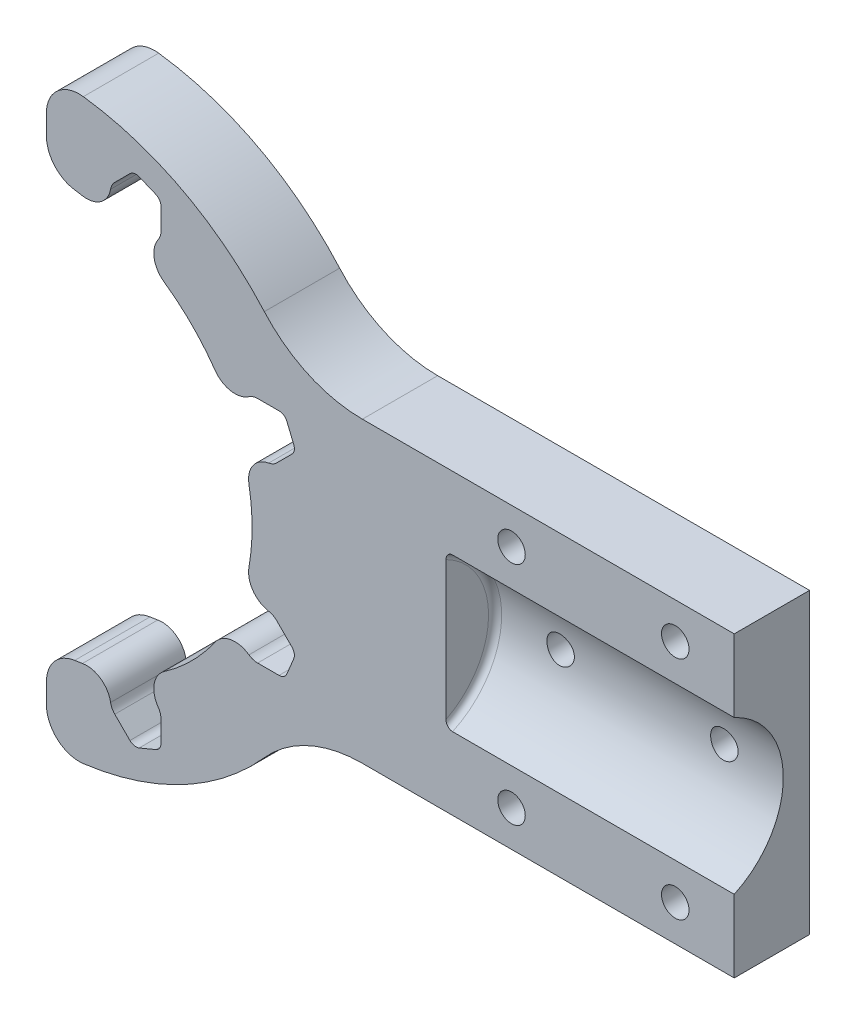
from build123d import *

# Parameters (mm, degrees)
BOSS_EXTRUDE1_DEPTH     = 50
BOSS_EXTRUDE2_DEPTH     = 11.5
BOSS_EXTRUDE3_DEPTH     = 6
CUT_EXTRUDE1_DEPTH      = 72.645324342
FILLET6_R               = 20
FILLET7_R               = 1
SKETCH6_R               = 2.1
CUT_EXTRUDE2_DEPTH      = 72.64532448
BOSS_EXTRUDE4_START     = -11.5
BOSS_EXTRUDE4_DEPTH     = 11.5
FILLET11_R              = 5
CUT_EXTRUDE3_DEPTH      = 72.448380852
CUT_EXTRUDE3_DEPTH_BACK = 72.448380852
SKETCH9_R               = 2.1


with BuildPart() as part:
    # Sketch1 → Boss-Extrude1 (new body)
    with BuildSketch(Plane.YZ):
        with BuildLine():
            Line((-11.683321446, 0), (-22.75, 0))
            Line((-22.75, 0), (-22.75, -11.5))
            Line((-22.75, -11.5), (22.75, -11.5))
            Line((22.75, -11.5), (22.75, 0))
            Line((22.75, 0), (11.683321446, 0))
            ThreePointArc((11.683321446, 0), (0, -7.5), (-11.683321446, 0))
        make_face()
    extrude(amount=BOSS_EXTRUDE1_DEPTH)

    # Sketch3 → Boss-Extrude2 (add)
    with BuildSketch(Plane.XY):
        with BuildLine():
            Line((0, 22.75), (-16.813091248, 22.75))
            ThreePointArc((-16.813091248, 22.75), (-33.039068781, 38.646086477), (-55, 44.45))
            Line((-55, 44.45), (-55, -44.45))
            ThreePointArc((-55, -44.45), (-33.039068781, -38.646086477), (-16.813091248, -22.75))
            Line((-16.813091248, -22.75), (0, -22.75))
            Line((0, -22.75), (0, 22.75))
        make_face()
    extrude(amount=-BOSS_EXTRUDE2_DEPTH)

    # Sketch4 → Boss-Extrude3 (add)
    with BuildSketch(Plane.YZ):
        with BuildLine():
            Line((11.683321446, 0), (-11.683321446, 0))
            ThreePointArc((-11.683321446, 0), (0, -7.5), (11.683321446, 0))
        make_face()
    extrude(amount=BOSS_EXTRUDE3_DEPTH)

    # Sketch5 → Cut-Extrude1 (cut, through all)
    with BuildSketch(Plane(origin=(0, 0, -11.5), x_dir=(1, 0, 0), z_dir=(0, 0, -1))):
        with BuildLine():
            Line((-18.104928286, 16.759017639), (-17.06082958, 14.238340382))
            ThreePointArc((-17.06082958, 14.238340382), (-16.975470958, 13.371679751), (-17.385988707, 12.603655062))
            Line((-17.385988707, 12.603655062), (-19.698227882, 10.291415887))
            ThreePointArc((-19.698227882, 10.291415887), (-20.315069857, 9.839864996), (-21.039526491, 9.595826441))
            ThreePointArc((-21.039526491, 9.595826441), (-23.307895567, 8.156938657), (-23.888378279, 5.534166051))
            ThreePointArc((-23.888378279, 5.534166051), (-23.4, 0), (-23.888378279, -5.534166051))
            ThreePointArc((-23.888378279, -5.534166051), (-23.307895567, -8.156938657), (-21.039526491, -9.595826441))
            ThreePointArc((-21.039526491, -9.595826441), (-20.315069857, -9.839864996), (-19.698227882, -10.291415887))
            Line((-19.698227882, -10.291415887), (-17.385988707, -12.603655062))
            ThreePointArc((-17.385988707, -12.603655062), (-16.975470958, -13.371679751), (-17.06082958, -14.238340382))
            Line((-17.06082958, -14.238340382), (-18.104928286, -16.759017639))
            ThreePointArc((-18.104928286, -16.759017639), (-18.657392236, -17.432196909), (-19.490747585, -17.684992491))
            Line((-19.490747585, -17.684992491), (-22.760747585, -17.684992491))
            ThreePointArc((-22.760747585, -17.684992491), (-23.516215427, -17.568114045), (-24.201044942, -17.228407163))
            ThreePointArc((-24.201044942, -17.228407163), (-26.822471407, -16.641875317), (-29.087514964, -18.085992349))
            ThreePointArc((-29.087514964, -18.085992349), (-32.655425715, -22.344574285), (-36.914007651, -25.912485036))
            ThreePointArc((-36.914007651, -25.912485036), (-38.358124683, -28.177528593), (-37.771592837, -30.798955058))
            ThreePointArc((-37.771592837, -30.798955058), (-37.431885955, -31.483784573), (-37.315007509, -32.239252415))
            Line((-37.315007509, -32.239252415), (-37.315007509, -35.509252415))
            ThreePointArc((-37.315007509, -35.509252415), (-37.567803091, -36.342607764), (-38.240982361, -36.895071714))
            Line((-38.240982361, -36.895071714), (-40.761659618, -37.93917042))
            ThreePointArc((-40.761659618, -37.93917042), (-41.628320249, -38.024529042), (-42.396344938, -37.614011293))
            Line((-42.396344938, -37.614011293), (-44.708584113, -35.301772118))
            ThreePointArc((-44.708584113, -35.301772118), (-45.160135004, -34.684930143), (-45.404173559, -33.960473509))
            ThreePointArc((-45.404173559, -33.960473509), (-46.843061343, -31.692104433), (-49.465833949, -31.111621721))
            ThreePointArc((-49.465833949, -31.111621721), (-52.222163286, -31.477668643), (-55, -31.6))
            Line((-55, -31.6), (-55, 31.6))
            ThreePointArc((-55, 31.6), (-52.222163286, 31.477668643), (-49.465833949, 31.111621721))
            ThreePointArc((-49.465833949, 31.111621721), (-46.843061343, 31.692104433), (-45.404173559, 33.960473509))
            ThreePointArc((-45.404173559, 33.960473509), (-45.160135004, 34.684930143), (-44.708584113, 35.301772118))
            Line((-44.708584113, 35.301772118), (-42.396344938, 37.614011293))
            ThreePointArc((-42.396344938, 37.614011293), (-41.628320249, 38.024529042), (-40.761659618, 37.93917042))
            Line((-40.761659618, 37.93917042), (-38.240982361, 36.895071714))
            ThreePointArc((-38.240982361, 36.895071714), (-37.567803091, 36.342607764), (-37.315007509, 35.509252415))
            Line((-37.315007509, 35.509252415), (-37.315007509, 32.239252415))
            ThreePointArc((-37.315007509, 32.239252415), (-37.431885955, 31.483784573), (-37.771592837, 30.798955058))
            ThreePointArc((-37.771592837, 30.798955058), (-38.358124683, 28.177528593), (-36.914007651, 25.912485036))
            ThreePointArc((-36.914007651, 25.912485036), (-32.655425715, 22.344574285), (-29.087514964, 18.085992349))
            ThreePointArc((-29.087514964, 18.085992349), (-26.822471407, 16.641875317), (-24.201044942, 17.228407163))
            ThreePointArc((-24.201044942, 17.228407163), (-23.516215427, 17.568114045), (-22.760747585, 17.684992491))
            Line((-22.760747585, 17.684992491), (-19.490747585, 17.684992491))
            ThreePointArc((-19.490747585, 17.684992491), (-18.657392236, 17.432196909), (-18.104928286, 16.759017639))
        make_face()
    extrude(amount=-CUT_EXTRUDE1_DEPTH, mode=Mode.SUBTRACT)

    # Fillet6
    fillet6_edges = [part.edges().sort_by_distance(p)[0] for p in [
        (-16.813091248, -22.75, -5.75),
        (-16.813091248, 22.75, -5.75),
    ]]
    fillet(fillet6_edges, radius=FILLET6_R)

    # Fillet7
    fillet7_edges = [part.edges().sort_by_distance(p)[0] for p in [
        (6, 0, -7.5),
    ]]
    fillet(fillet7_edges, radius=FILLET7_R)

    # Sketch6 → Cut-Extrude2 (cut, through all)
    with BuildSketch(Plane.XY):
        with Locations((41, 17.25)):
            Circle(SKETCH6_R)
        with Locations((16, 17.25)):
            Circle(SKETCH6_R)
        with Locations((16, -17.25)):
            Circle(SKETCH6_R)
        with Locations((41, -17.25)):
            Circle(SKETCH6_R)
    extrude(amount=-CUT_EXTRUDE2_DEPTH, mode=Mode.SUBTRACT)

    # Sketch8 → Boss-Extrude4 (add)
    with BuildSketch(Plane.XY.offset(BOSS_EXTRUDE4_START)):
        with BuildLine():
            Line((-19.490747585, -17.484992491), (-22.760747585, -17.484992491))
            ThreePointArc((-22.760747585, -17.484992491), (-23.455777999, -17.37746432), (-24.085821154, -17.064933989))
            ThreePointArc((-24.085821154, -17.064933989), (-26.857043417, -16.444886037), (-29.251518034, -17.971524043))
            ThreePointArc((-29.251518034, -17.971524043), (-32.796847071, -22.203152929), (-37.028475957, -25.748481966))
            ThreePointArc((-37.028475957, -25.748481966), (-38.555113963, -28.142956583), (-37.935066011, -30.914178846))
            ThreePointArc((-37.935066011, -30.914178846), (-37.62253568, -31.544222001), (-37.515007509, -32.239252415))
            Line((-37.515007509, -32.239252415), (-37.515007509, -35.509252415))
            ThreePointArc((-37.515007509, -35.509252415), (-37.734097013, -36.231493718), (-38.317519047, -36.710295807))
            Line((-38.317519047, -36.710295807), (-40.838196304, -37.754394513))
            ThreePointArc((-40.838196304, -37.754394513), (-41.589302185, -37.828371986), (-42.254923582, -37.472589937))
            Line((-42.254923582, -37.472589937), (-44.567162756, -35.160350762))
            ThreePointArc((-44.567162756, -35.160350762), (-44.982589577, -34.592856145), (-45.207105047, -33.926356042))
            ThreePointArc((-45.207105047, -33.926356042), (-46.72821499, -31.528365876), (-49.500860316, -30.914712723))
            ThreePointArc((-49.500860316, -30.914712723), (-52.239744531, -31.278442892), (-55, -31.4))
            Line((-55, -31.4), (-55, -31.6))
            ThreePointArc((-55, -31.6), (-52.222163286, -31.477668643), (-49.465833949, -31.111621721))
            ThreePointArc((-49.465833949, -31.111621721), (-46.843061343, -31.692104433), (-45.404173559, -33.960473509))
            ThreePointArc((-45.404173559, -33.960473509), (-45.160135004, -34.684930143), (-44.708584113, -35.301772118))
            Line((-44.708584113, -35.301772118), (-42.396344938, -37.614011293))
            ThreePointArc((-42.396344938, -37.614011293), (-41.628320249, -38.024529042), (-40.761659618, -37.93917042))
            Line((-40.761659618, -37.93917042), (-38.240982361, -36.895071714))
            ThreePointArc((-38.240982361, -36.895071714), (-37.567803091, -36.342607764), (-37.315007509, -35.509252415))
            Line((-37.315007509, -35.509252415), (-37.315007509, -32.239252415))
            ThreePointArc((-37.315007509, -32.239252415), (-37.431885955, -31.483784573), (-37.771592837, -30.798955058))
            ThreePointArc((-37.771592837, -30.798955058), (-38.358124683, -28.177528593), (-36.914007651, -25.912485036))
            ThreePointArc((-36.914007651, -25.912485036), (-32.655425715, -22.344574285), (-29.087514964, -18.085992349))
            ThreePointArc((-29.087514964, -18.085992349), (-26.822471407, -16.641875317), (-24.201044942, -17.228407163))
            ThreePointArc((-24.201044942, -17.228407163), (-23.516215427, -17.568114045), (-22.760747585, -17.684992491))
            Line((-22.760747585, -17.684992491), (-19.490747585, -17.684992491))
            ThreePointArc((-19.490747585, -17.684992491), (-18.657392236, -17.432196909), (-18.104928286, -16.759017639))
            Line((-18.104928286, -16.759017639), (-17.06082958, -14.238340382))
            ThreePointArc((-17.06082958, -14.238340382), (-16.975470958, -13.371679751), (-17.385988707, -12.603655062))
            Line((-17.385988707, -12.603655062), (-19.698227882, -10.291415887))
            ThreePointArc((-19.698227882, -10.291415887), (-20.315069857, -9.839864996), (-21.039526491, -9.595826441))
            ThreePointArc((-21.039526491, -9.595826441), (-23.307895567, -8.156938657), (-23.888378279, -5.534166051))
            ThreePointArc((-23.888378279, -5.534166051), (-23.4, 0), (-23.888378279, 5.534166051))
            ThreePointArc((-23.888378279, 5.534166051), (-23.307895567, 8.156938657), (-21.039526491, 9.595826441))
            ThreePointArc((-21.039526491, 9.595826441), (-20.315069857, 9.839864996), (-19.698227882, 10.291415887))
            Line((-19.698227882, 10.291415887), (-17.385988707, 12.603655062))
            ThreePointArc((-17.385988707, 12.603655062), (-16.975470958, 13.371679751), (-17.06082958, 14.238340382))
            Line((-17.06082958, 14.238340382), (-18.104928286, 16.759017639))
            ThreePointArc((-18.104928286, 16.759017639), (-18.657392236, 17.432196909), (-19.490747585, 17.684992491))
            Line((-19.490747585, 17.684992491), (-22.760747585, 17.684992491))
            ThreePointArc((-22.760747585, 17.684992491), (-23.516215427, 17.568114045), (-24.201044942, 17.228407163))
            ThreePointArc((-24.201044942, 17.228407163), (-26.822471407, 16.641875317), (-29.087514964, 18.085992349))
            ThreePointArc((-29.087514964, 18.085992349), (-32.655425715, 22.344574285), (-36.914007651, 25.912485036))
            ThreePointArc((-36.914007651, 25.912485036), (-38.358124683, 28.177528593), (-37.771592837, 30.798955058))
            ThreePointArc((-37.771592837, 30.798955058), (-37.431885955, 31.483784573), (-37.315007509, 32.239252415))
            Line((-37.315007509, 32.239252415), (-37.315007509, 35.509252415))
            ThreePointArc((-37.315007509, 35.509252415), (-37.567803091, 36.342607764), (-38.240982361, 36.895071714))
            Line((-38.240982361, 36.895071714), (-40.761659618, 37.93917042))
            ThreePointArc((-40.761659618, 37.93917042), (-41.628320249, 38.024529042), (-42.396344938, 37.614011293))
            Line((-42.396344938, 37.614011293), (-44.708584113, 35.301772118))
            ThreePointArc((-44.708584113, 35.301772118), (-45.160135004, 34.684930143), (-45.404173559, 33.960473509))
            ThreePointArc((-45.404173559, 33.960473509), (-46.843061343, 31.692104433), (-49.465833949, 31.111621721))
            ThreePointArc((-49.465833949, 31.111621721), (-52.222163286, 31.477668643), (-55, 31.6))
            Line((-55, 31.6), (-55, 31.4))
            ThreePointArc((-55, 31.4), (-52.239744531, 31.278442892), (-49.500860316, 30.914712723))
            ThreePointArc((-49.500860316, 30.914712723), (-46.72821499, 31.528365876), (-45.207105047, 33.926356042))
            ThreePointArc((-45.207105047, 33.926356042), (-44.982589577, 34.592856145), (-44.567162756, 35.160350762))
            Line((-44.567162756, 35.160350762), (-42.254923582, 37.472589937))
            ThreePointArc((-42.254923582, 37.472589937), (-41.589302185, 37.828371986), (-40.838196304, 37.754394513))
            Line((-40.838196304, 37.754394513), (-38.317519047, 36.710295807))
            ThreePointArc((-38.317519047, 36.710295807), (-37.734097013, 36.231493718), (-37.515007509, 35.509252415))
            Line((-37.515007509, 35.509252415), (-37.515007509, 32.239252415))
            ThreePointArc((-37.515007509, 32.239252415), (-37.62253568, 31.544222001), (-37.935066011, 30.914178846))
            ThreePointArc((-37.935066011, 30.914178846), (-38.555113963, 28.142956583), (-37.028475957, 25.748481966))
            ThreePointArc((-37.028475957, 25.748481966), (-32.796847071, 22.203152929), (-29.251518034, 17.971524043))
            ThreePointArc((-29.251518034, 17.971524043), (-26.857043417, 16.444886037), (-24.085821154, 17.064933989))
            ThreePointArc((-24.085821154, 17.064933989), (-23.455777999, 17.37746432), (-22.760747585, 17.484992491))
            Line((-22.760747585, 17.484992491), (-19.490747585, 17.484992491))
            ThreePointArc((-19.490747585, 17.484992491), (-18.768506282, 17.265902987), (-18.289704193, 16.682480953))
            Line((-18.289704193, 16.682480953), (-17.245605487, 14.161803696))
            ThreePointArc((-17.245605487, 14.161803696), (-17.171628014, 13.410697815), (-17.527410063, 12.745076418))
            Line((-17.527410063, 12.745076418), (-19.839649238, 10.432837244))
            ThreePointArc((-19.839649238, 10.432837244), (-20.407143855, 10.017410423), (-21.073643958, 9.792894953))
            ThreePointArc((-21.073643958, 9.792894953), (-23.471634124, 8.27178501), (-24.085287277, 5.499139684))
            ThreePointArc((-24.085287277, 5.499139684), (-23.6, 0), (-24.085287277, -5.499139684))
            ThreePointArc((-24.085287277, -5.499139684), (-23.471634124, -8.27178501), (-21.073643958, -9.792894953))
            ThreePointArc((-21.073643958, -9.792894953), (-20.407143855, -10.017410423), (-19.839649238, -10.432837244))
            Line((-19.839649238, -10.432837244), (-17.527410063, -12.745076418))
            ThreePointArc((-17.527410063, -12.745076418), (-17.171628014, -13.410697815), (-17.245605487, -14.161803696))
            Line((-17.245605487, -14.161803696), (-18.289704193, -16.682480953))
            ThreePointArc((-18.289704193, -16.682480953), (-18.768506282, -17.265902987), (-19.490747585, -17.484992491))
        make_face()
    extrude(amount=BOSS_EXTRUDE4_DEPTH)

    # Fillet11
    fillet11_edges = [part.edges().sort_by_distance(p)[0] for p in [
        (-55, -44.45, -5.75),
        (-55, 44.45, -5.75),
        (-55, -31.4, -5.75),
        (-55, 31.4, -5.75),
    ]]
    fillet(fillet11_edges, radius=FILLET11_R)

    # Sketch9 → Cut-Extrude3 (cut, two sides: drawn at the far end of the back side and taken through both)
    with BuildSketch(Plane(origin=(0, 0, -11.5), x_dir=(1, 0, 0), z_dir=(0, 0, -1)).offset(-CUT_EXTRUDE3_DEPTH_BACK)):
        with Locations(Location((16, 0, 0), (0, 0, 180))):
            Circle(SKETCH9_R)
        with Locations(Location((41, 0, 0), (0, 0, 180))):
            Circle(SKETCH9_R)
    extrude(amount=CUT_EXTRUDE3_DEPTH + CUT_EXTRUDE3_DEPTH_BACK, mode=Mode.SUBTRACT)


solid = part.part
